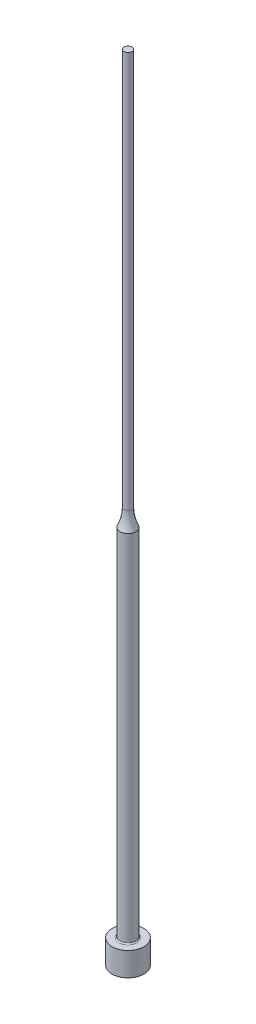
ISO-10303-21;
HEADER;
FILE_DESCRIPTION(('STEP AP214'),'2;1');
FILE_NAME('part.step','',(''),(''),'','','');
FILE_SCHEMA(('AUTOMOTIVE_DESIGN { 1 0 10303 214 1 1 1 1 }'));
ENDSEC;
DATA;
#1=APPLICATION_CONTEXT('core data for automotive mechanical design processes');
#2=APPLICATION_PROTOCOL_DEFINITION('international standard','automotive_design',2000,#1);
#3=PRODUCT_CONTEXT('',#1,'mechanical');
#4=PRODUCT('Part','Part','',(#3));
#5=PRODUCT_RELATED_PRODUCT_CATEGORY('part','',(#4));
#6=PRODUCT_DEFINITION_FORMATION('','',#4);
#7=PRODUCT_DEFINITION_CONTEXT('part definition',#1,'design');
#8=PRODUCT_DEFINITION('design','',#6,#7);
#9=PRODUCT_DEFINITION_SHAPE('','',#8);
#10=(LENGTH_UNIT() NAMED_UNIT(*) SI_UNIT(.MILLI.,.METRE.));
#11=(NAMED_UNIT(*) PLANE_ANGLE_UNIT() SI_UNIT($,.RADIAN.));
#12=(NAMED_UNIT(*) SI_UNIT($,.STERADIAN.) SOLID_ANGLE_UNIT());
#13=UNCERTAINTY_MEASURE_WITH_UNIT(LENGTH_MEASURE(1.E-05),#10,'distance_accuracy_value','');
#14=(GEOMETRIC_REPRESENTATION_CONTEXT(3) GLOBAL_UNCERTAINTY_ASSIGNED_CONTEXT((#13)) GLOBAL_UNIT_ASSIGNED_CONTEXT((#10,
#11,#12)) REPRESENTATION_CONTEXT('',''));
#15=CARTESIAN_POINT('',(0.,0.,0.));
#16=DIRECTION('',(0.,0.,1.));
#17=DIRECTION('',(1.,0.,0.));
#18=AXIS2_PLACEMENT_3D('',#15,#16,#17);
#19=CARTESIAN_POINT('',(1.00000000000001,200.,0.));
#20=DIRECTION('',(0.,-1.,0.));
#21=DIRECTION('',(1.,0.,0.));
#22=AXIS2_PLACEMENT_3D('',#19,#20,#21);
#23=PLANE('',#22);
#24=CARTESIAN_POINT('',(0.,200.,0.));
#25=DIRECTION('',(0.,1.,0.));
#26=DIRECTION('',(-1.,0.,0.));
#27=AXIS2_PLACEMENT_3D('',#24,#25,#26);
#28=CIRCLE('',#27,1.00000000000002);
#29=CARTESIAN_POINT('',(-1.00000000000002,200.,0.));
#30=VERTEX_POINT('',#29);
#31=EDGE_CURVE('E10',#30,#30,#28,.T.);
#32=ORIENTED_EDGE('',*,*,#31,.T.);
#33=EDGE_LOOP('',(#32));
#34=FACE_BOUND('',#33,.T.);
#35=ADVANCED_FACE('F30',(#34),#23,.F.);
#36=CARTESIAN_POINT('',(0.,200.,0.));
#37=DIRECTION('',(0.,1.,0.));
#38=DIRECTION('',(-1.,0.,0.));
#39=AXIS2_PLACEMENT_3D('',#36,#37,#38);
#40=CYLINDRICAL_SURFACE('',#39,1.00000000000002);
#41=ORIENTED_EDGE('',*,*,#31,.F.);
#42=EDGE_LOOP('',(#41));
#43=FACE_BOUND('',#42,.T.);
#44=CARTESIAN_POINT('',(0.,100.,0.));
#45=DIRECTION('',(0.,1.,0.));
#46=DIRECTION('',(-1.,0.,0.));
#47=AXIS2_PLACEMENT_3D('',#44,#45,#46);
#48=CIRCLE('',#47,1.00000000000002);
#49=CARTESIAN_POINT('',(-1.00000000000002,100.,0.));
#50=VERTEX_POINT('',#49);
#51=EDGE_CURVE('E36',#50,#50,#48,.T.);
#52=ORIENTED_EDGE('',*,*,#51,.T.);
#53=EDGE_LOOP('',(#52));
#54=FACE_BOUND('',#53,.T.);
#55=ADVANCED_FACE('F71',(#43,#54),#40,.T.);
#56=CARTESIAN_POINT('',(0.,100.,0.));
#57=DIRECTION('',(0.,1.,0.));
#58=DIRECTION('',(-1.,0.,0.));
#59=AXIS2_PLACEMENT_3D('',#56,#57,#58);
#60=TOROIDAL_SURFACE('',#59,11.,10.);
#61=ORIENTED_EDGE('',*,*,#51,.F.);
#62=EDGE_LOOP('',(#61));
#63=FACE_BOUND('',#62,.T.);
#64=CARTESIAN_POINT('',(0.,95.6411010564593,0.));
#65=DIRECTION('',(0.,1.,0.));
#66=DIRECTION('',(-1.,0.,0.));
#67=AXIS2_PLACEMENT_3D('',#64,#65,#66);
#68=CIRCLE('',#67,2.00000000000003);
#69=CARTESIAN_POINT('',(-2.00000000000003,95.6411010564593,0.));
#70=VERTEX_POINT('',#69);
#71=EDGE_CURVE('E40',#70,#70,#68,.T.);
#72=ORIENTED_EDGE('',*,*,#71,.T.);
#73=EDGE_LOOP('',(#72));
#74=FACE_BOUND('',#73,.T.);
#75=ADVANCED_FACE('F75',(#63,#74),#60,.F.);
#76=CARTESIAN_POINT('',(0.,200.,0.));
#77=DIRECTION('',(0.,1.,0.));
#78=DIRECTION('',(-1.,0.,0.));
#79=AXIS2_PLACEMENT_3D('',#76,#77,#78);
#80=CYLINDRICAL_SURFACE('',#79,2.00000000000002);
#81=ORIENTED_EDGE('',*,*,#71,.F.);
#82=EDGE_LOOP('',(#81));
#83=FACE_BOUND('',#82,.T.);
#84=CARTESIAN_POINT('',(0.,6.3,0.));
#85=DIRECTION('',(0.,1.,0.));
#86=DIRECTION('',(-1.,0.,0.));
#87=AXIS2_PLACEMENT_3D('',#84,#85,#86);
#88=CIRCLE('',#87,2.00000000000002);
#89=CARTESIAN_POINT('',(-2.00000000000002,6.3,0.));
#90=VERTEX_POINT('',#89);
#91=EDGE_CURVE('E44',#90,#90,#88,.T.);
#92=ORIENTED_EDGE('',*,*,#91,.T.);
#93=EDGE_LOOP('',(#92));
#94=FACE_BOUND('',#93,.T.);
#95=ADVANCED_FACE('F80',(#83,#94),#80,.T.);
#96=CARTESIAN_POINT('',(0.,6.3,0.));
#97=DIRECTION('',(0.,1.,0.));
#98=DIRECTION('',(-1.,0.,0.));
#99=AXIS2_PLACEMENT_3D('',#96,#97,#98);
#100=TOROIDAL_SURFACE('',#99,2.30000000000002,0.3);
#101=ORIENTED_EDGE('',*,*,#91,.F.);
#102=EDGE_LOOP('',(#101));
#103=FACE_BOUND('',#102,.T.);
#104=CARTESIAN_POINT('',(0.,6.00000000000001,0.));
#105=DIRECTION('',(0.,1.,0.));
#106=DIRECTION('',(-1.,0.,0.));
#107=AXIS2_PLACEMENT_3D('',#104,#105,#106);
#108=CIRCLE('',#107,2.30000000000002);
#109=CARTESIAN_POINT('',(-2.30000000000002,6.00000000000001,0.));
#110=VERTEX_POINT('',#109);
#111=EDGE_CURVE('E49',#110,#110,#108,.T.);
#112=ORIENTED_EDGE('',*,*,#111,.T.);
#113=EDGE_LOOP('',(#112));
#114=FACE_BOUND('',#113,.T.);
#115=ADVANCED_FACE('F86',(#103,#114),#100,.F.);
#116=CARTESIAN_POINT('',(4.00000000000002,6.,0.));
#117=DIRECTION('',(0.,-1.,0.));
#118=DIRECTION('',(1.,0.,0.));
#119=AXIS2_PLACEMENT_3D('',#116,#117,#118);
#120=PLANE('',#119);
#121=ORIENTED_EDGE('',*,*,#111,.F.);
#122=EDGE_LOOP('',(#121));
#123=FACE_BOUND('',#122,.T.);
#124=CARTESIAN_POINT('',(0.,6.00000000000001,0.));
#125=DIRECTION('',(0.,1.,0.));
#126=DIRECTION('',(-1.,0.,0.));
#127=AXIS2_PLACEMENT_3D('',#124,#125,#126);
#128=CIRCLE('',#127,4.00000000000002);
#129=CARTESIAN_POINT('',(-4.00000000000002,6.00000000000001,0.));
#130=VERTEX_POINT('',#129);
#131=EDGE_CURVE('E52',#130,#130,#128,.T.);
#132=ORIENTED_EDGE('',*,*,#131,.T.);
#133=EDGE_LOOP('',(#132));
#134=FACE_BOUND('',#133,.T.);
#135=ADVANCED_FACE('F67',(#123,#134),#120,.F.);
#136=CARTESIAN_POINT('',(0.,200.,0.));
#137=DIRECTION('',(0.,1.,0.));
#138=DIRECTION('',(-1.,0.,0.));
#139=AXIS2_PLACEMENT_3D('',#136,#137,#138);
#140=CYLINDRICAL_SURFACE('',#139,4.00000000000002);
#141=ORIENTED_EDGE('',*,*,#131,.F.);
#142=EDGE_LOOP('',(#141));
#143=FACE_BOUND('',#142,.T.);
#144=CARTESIAN_POINT('',(0.,0.,0.));
#145=DIRECTION('',(0.,1.,0.));
#146=DIRECTION('',(-1.,0.,0.));
#147=AXIS2_PLACEMENT_3D('',#144,#145,#146);
#148=CIRCLE('',#147,4.00000000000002);
#149=CARTESIAN_POINT('',(-4.00000000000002,0.,0.));
#150=VERTEX_POINT('',#149);
#151=EDGE_CURVE('E55',#150,#150,#148,.T.);
#152=ORIENTED_EDGE('',*,*,#151,.T.);
#153=EDGE_LOOP('',(#152));
#154=FACE_BOUND('',#153,.T.);
#155=ADVANCED_FACE('F59',(#143,#154),#140,.T.);
#156=CARTESIAN_POINT('',(0.,0.,0.));
#157=DIRECTION('',(0.,1.,0.));
#158=DIRECTION('',(-1.,0.,0.));
#159=AXIS2_PLACEMENT_3D('',#156,#157,#158);
#160=PLANE('',#159);
#161=ORIENTED_EDGE('',*,*,#151,.F.);
#162=EDGE_LOOP('',(#161));
#163=FACE_BOUND('',#162,.T.);
#164=ADVANCED_FACE('F61',(#163),#160,.F.);
#165=CLOSED_SHELL('',(#35,#55,#75,#95,#115,#135,#155,#164));
#166=MANIFOLD_SOLID_BREP('B2',#165);
#167=ADVANCED_BREP_SHAPE_REPRESENTATION('',(#18,#166),#14);
#168=SHAPE_DEFINITION_REPRESENTATION(#9,#167);
ENDSEC;
END-ISO-10303-21;
